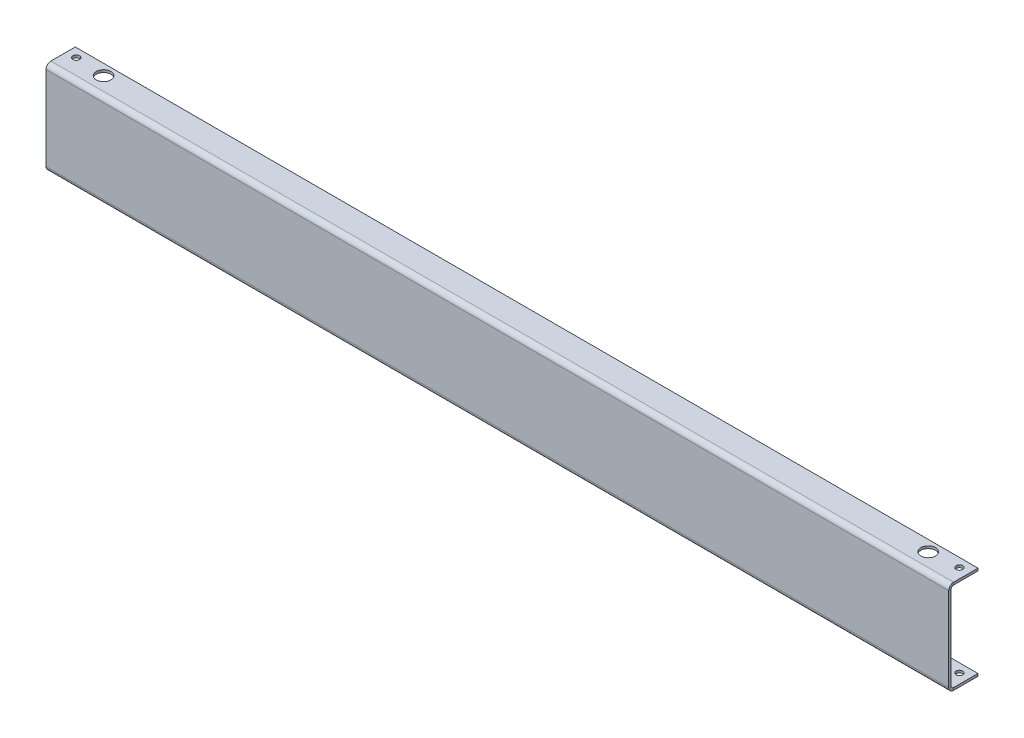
ISO-10303-21;
HEADER;
FILE_DESCRIPTION(('STEP AP214'),'2;1');
FILE_NAME('part.step','',(''),(''),'','','');
FILE_SCHEMA(('AUTOMOTIVE_DESIGN { 1 0 10303 214 1 1 1 1 }'));
ENDSEC;
DATA;
#1=APPLICATION_CONTEXT('core data for automotive mechanical design processes');
#2=APPLICATION_PROTOCOL_DEFINITION('international standard','automotive_design',2000,#1);
#3=PRODUCT_CONTEXT('',#1,'mechanical');
#4=PRODUCT('Part','Part','',(#3));
#5=PRODUCT_RELATED_PRODUCT_CATEGORY('part','',(#4));
#6=PRODUCT_DEFINITION_FORMATION('','',#4);
#7=PRODUCT_DEFINITION_CONTEXT('part definition',#1,'design');
#8=PRODUCT_DEFINITION('design','',#6,#7);
#9=PRODUCT_DEFINITION_SHAPE('','',#8);
#10=(LENGTH_UNIT() NAMED_UNIT(*) SI_UNIT(.MILLI.,.METRE.));
#11=(NAMED_UNIT(*) PLANE_ANGLE_UNIT() SI_UNIT($,.RADIAN.));
#12=(NAMED_UNIT(*) SI_UNIT($,.STERADIAN.) SOLID_ANGLE_UNIT());
#13=UNCERTAINTY_MEASURE_WITH_UNIT(LENGTH_MEASURE(1.E-05),#10,'distance_accuracy_value','');
#14=(GEOMETRIC_REPRESENTATION_CONTEXT(3) GLOBAL_UNCERTAINTY_ASSIGNED_CONTEXT((#13)) GLOBAL_UNIT_ASSIGNED_CONTEXT((#10,
#11,#12)) REPRESENTATION_CONTEXT('',''));
#15=CARTESIAN_POINT('',(0.,0.,0.));
#16=DIRECTION('',(0.,0.,1.));
#17=DIRECTION('',(1.,0.,0.));
#18=AXIS2_PLACEMENT_3D('',#15,#16,#17);
#19=CARTESIAN_POINT('',(925.,0.,0.));
#20=DIRECTION('',(0.,-1.,0.));
#21=DIRECTION('',(0.,0.,-1.));
#22=AXIS2_PLACEMENT_3D('',#19,#20,#21);
#23=PLANE('',#22);
#24=CARTESIAN_POINT('',(40.,0.,11.));
#25=DIRECTION('',(0.,1.,0.));
#26=DIRECTION('',(0.,0.,1.));
#27=AXIS2_PLACEMENT_3D('',#24,#25,#26);
#28=CIRCLE('',#27,7.49999999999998);
#29=CARTESIAN_POINT('',(40.,0.,18.4999999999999));
#30=VERTEX_POINT('',#29);
#31=EDGE_CURVE('E320',#30,#30,#28,.T.);
#32=ORIENTED_EDGE('',*,*,#31,.T.);
#33=EDGE_LOOP('',(#32));
#34=FACE_BOUND('',#33,.T.);
#35=CARTESIAN_POINT('',(915.,0.,8.99999999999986));
#36=DIRECTION('',(0.,1.,0.));
#37=DIRECTION('',(0.,0.,1.));
#38=AXIS2_PLACEMENT_3D('',#35,#36,#37);
#39=CIRCLE('',#38,3.39999999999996);
#40=CARTESIAN_POINT('',(915.,0.,12.3999999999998));
#41=VERTEX_POINT('',#40);
#42=EDGE_CURVE('E340',#41,#41,#39,.T.);
#43=ORIENTED_EDGE('',*,*,#42,.T.);
#44=EDGE_LOOP('',(#43));
#45=FACE_BOUND('',#44,.T.);
#46=DIRECTION('',(0.,0.,1.));
#47=VECTOR('',#46,1.);
#48=CARTESIAN_POINT('',(0.,0.,0.));
#49=LINE('',#48,#47);
#50=CARTESIAN_POINT('',(0.,0.,0.));
#51=VERTEX_POINT('',#50);
#52=CARTESIAN_POINT('',(0.,0.,25.));
#53=VERTEX_POINT('',#52);
#54=EDGE_CURVE('E176',#51,#53,#49,.T.);
#55=ORIENTED_EDGE('',*,*,#54,.F.);
#56=DIRECTION('',(-1.,0.,0.));
#57=VECTOR('',#56,1.);
#58=CARTESIAN_POINT('',(925.,0.,0.));
#59=LINE('',#58,#57);
#60=CARTESIAN_POINT('',(925.,0.,0.));
#61=VERTEX_POINT('',#60);
#62=EDGE_CURVE('E259',#61,#51,#59,.T.);
#63=ORIENTED_EDGE('',*,*,#62,.F.);
#64=DIRECTION('',(0.,0.,1.));
#65=VECTOR('',#64,1.);
#66=CARTESIAN_POINT('',(925.,0.,0.));
#67=LINE('',#66,#65);
#68=CARTESIAN_POINT('',(925.,0.,25.));
#69=VERTEX_POINT('',#68);
#70=EDGE_CURVE('E220',#61,#69,#67,.T.);
#71=ORIENTED_EDGE('',*,*,#70,.T.);
#72=DIRECTION('',(-1.,0.,0.));
#73=VECTOR('',#72,1.);
#74=CARTESIAN_POINT('',(925.,0.,25.));
#75=LINE('',#74,#73);
#76=EDGE_CURVE('E262',#69,#53,#75,.T.);
#77=ORIENTED_EDGE('',*,*,#76,.T.);
#78=EDGE_LOOP('',(#55,#63,#71,#77));
#79=FACE_BOUND('',#78,.T.);
#80=CARTESIAN_POINT('',(10.,0.,8.99999999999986));
#81=DIRECTION('',(0.,1.,0.));
#82=DIRECTION('',(0.,0.,1.));
#83=AXIS2_PLACEMENT_3D('',#80,#81,#82);
#84=CIRCLE('',#83,3.39999999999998);
#85=CARTESIAN_POINT('',(10.,0.,12.3999999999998));
#86=VERTEX_POINT('',#85);
#87=EDGE_CURVE('E316',#86,#86,#84,.T.);
#88=ORIENTED_EDGE('',*,*,#87,.T.);
#89=EDGE_LOOP('',(#88));
#90=FACE_BOUND('',#89,.T.);
#91=CARTESIAN_POINT('',(885.,0.,11.));
#92=DIRECTION('',(0.,1.,0.));
#93=DIRECTION('',(0.,0.,1.));
#94=AXIS2_PLACEMENT_3D('',#91,#92,#93);
#95=CIRCLE('',#94,7.49999999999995);
#96=CARTESIAN_POINT('',(885.,0.,18.4999999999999));
#97=VERTEX_POINT('',#96);
#98=EDGE_CURVE('E492',#97,#97,#95,.T.);
#99=ORIENTED_EDGE('',*,*,#98,.T.);
#100=EDGE_LOOP('',(#99));
#101=FACE_BOUND('',#100,.T.);
#102=ADVANCED_FACE('F38',(#34,#45,#79,#90,#101),#23,.T.);
#103=CARTESIAN_POINT('',(925.,5.,30.));
#104=DIRECTION('',(1.,0.,0.));
#105=DIRECTION('',(0.,0.,-1.));
#106=AXIS2_PLACEMENT_3D('',#103,#104,#105);
#107=PLANE('',#106);
#108=DIRECTION('',(0.,0.,-1.));
#109=VECTOR('',#108,1.);
#110=CARTESIAN_POINT('',(925.,5.,30.));
#111=LINE('',#110,#109);
#112=CARTESIAN_POINT('',(925.,5.,30.));
#113=VERTEX_POINT('',#112);
#114=CARTESIAN_POINT('',(925.,5.,27.5));
#115=VERTEX_POINT('',#114);
#116=EDGE_CURVE('E11',#113,#115,#111,.T.);
#117=ORIENTED_EDGE('',*,*,#116,.F.);
#118=CARTESIAN_POINT('',(925.,5.,25.));
#119=DIRECTION('',(1.,0.,0.));
#120=DIRECTION('',(0.,0.,-1.));
#121=AXIS2_PLACEMENT_3D('',#118,#119,#120);
#122=CIRCLE('',#121,5.);
#123=EDGE_CURVE('E216',#69,#113,#122,.F.);
#124=ORIENTED_EDGE('',*,*,#123,.F.);
#125=DIRECTION('',(0.,-1.,0.));
#126=VECTOR('',#125,1.);
#127=CARTESIAN_POINT('',(925.,2.5,25.));
#128=LINE('',#127,#126);
#129=CARTESIAN_POINT('',(925.,2.5,25.));
#130=VERTEX_POINT('',#129);
#131=EDGE_CURVE('E48',#130,#69,#128,.T.);
#132=ORIENTED_EDGE('',*,*,#131,.F.);
#133=CARTESIAN_POINT('',(925.,5.,25.));
#134=DIRECTION('',(1.,0.,0.));
#135=DIRECTION('',(0.,0.,-1.));
#136=AXIS2_PLACEMENT_3D('',#133,#134,#135);
#137=CIRCLE('',#136,2.5);
#138=EDGE_CURVE('E232',#130,#115,#137,.F.);
#139=ORIENTED_EDGE('',*,*,#138,.T.);
#140=EDGE_LOOP('',(#117,#124,#132,#139));
#141=FACE_BOUND('',#140,.T.);
#142=ADVANCED_FACE('F40',(#141),#107,.T.);
#143=CARTESIAN_POINT('',(925.,2.5,25.));
#144=DIRECTION('',(1.,0.,0.));
#145=DIRECTION('',(0.,0.,-1.));
#146=AXIS2_PLACEMENT_3D('',#143,#144,#145);
#147=PLANE('',#146);
#148=DIRECTION('',(0.,1.,0.));
#149=VECTOR('',#148,1.);
#150=CARTESIAN_POINT('',(925.,0.,30.));
#151=LINE('',#150,#149);
#152=CARTESIAN_POINT('',(925.,91.,30.));
#153=VERTEX_POINT('',#152);
#154=EDGE_CURVE('E212',#113,#153,#151,.T.);
#155=ORIENTED_EDGE('',*,*,#154,.F.);
#156=ORIENTED_EDGE('',*,*,#116,.T.);
#157=DIRECTION('',(0.,1.,0.));
#158=VECTOR('',#157,1.);
#159=CARTESIAN_POINT('',(925.,0.,27.5));
#160=LINE('',#159,#158);
#161=CARTESIAN_POINT('',(925.,91.,27.5));
#162=VERTEX_POINT('',#161);
#163=EDGE_CURVE('E236',#115,#162,#160,.T.);
#164=ORIENTED_EDGE('',*,*,#163,.T.);
#165=DIRECTION('',(0.,0.,1.));
#166=VECTOR('',#165,1.);
#167=CARTESIAN_POINT('',(925.,91.,27.5));
#168=LINE('',#167,#166);
#169=EDGE_CURVE('E63',#162,#153,#168,.T.);
#170=ORIENTED_EDGE('',*,*,#169,.T.);
#171=EDGE_LOOP('',(#155,#156,#164,#170));
#172=FACE_BOUND('',#171,.T.);
#173=ADVANCED_FACE('F371',(#172),#147,.T.);
#174=CARTESIAN_POINT('',(0.,0.,25.));
#175=DIRECTION('',(-1.,0.,0.));
#176=DIRECTION('',(0.,0.,1.));
#177=AXIS2_PLACEMENT_3D('',#174,#175,#176);
#178=PLANE('',#177);
#179=DIRECTION('',(0.,1.,0.));
#180=VECTOR('',#179,1.);
#181=CARTESIAN_POINT('',(0.,0.,25.));
#182=LINE('',#181,#180);
#183=CARTESIAN_POINT('',(0.,2.5,25.));
#184=VERTEX_POINT('',#183);
#185=EDGE_CURVE('E292',#53,#184,#182,.T.);
#186=ORIENTED_EDGE('',*,*,#185,.F.);
#187=CARTESIAN_POINT('',(0.,5.,25.));
#188=DIRECTION('',(1.,0.,0.));
#189=DIRECTION('',(0.,0.,-1.));
#190=AXIS2_PLACEMENT_3D('',#187,#188,#189);
#191=CIRCLE('',#190,5.);
#192=CARTESIAN_POINT('',(0.,5.,30.));
#193=VERTEX_POINT('',#192);
#194=EDGE_CURVE('E172',#53,#193,#191,.F.);
#195=ORIENTED_EDGE('',*,*,#194,.T.);
#196=DIRECTION('',(0.,0.,1.));
#197=VECTOR('',#196,1.);
#198=CARTESIAN_POINT('',(0.,5.,27.5));
#199=LINE('',#198,#197);
#200=CARTESIAN_POINT('',(0.,5.,27.5));
#201=VERTEX_POINT('',#200);
#202=EDGE_CURVE('E289',#201,#193,#199,.T.);
#203=ORIENTED_EDGE('',*,*,#202,.F.);
#204=CARTESIAN_POINT('',(0.,5.,25.));
#205=DIRECTION('',(1.,0.,0.));
#206=DIRECTION('',(0.,0.,-1.));
#207=AXIS2_PLACEMENT_3D('',#204,#205,#206);
#208=CIRCLE('',#207,2.5);
#209=EDGE_CURVE('E188',#184,#201,#208,.F.);
#210=ORIENTED_EDGE('',*,*,#209,.F.);
#211=EDGE_LOOP('',(#186,#195,#203,#210));
#212=FACE_BOUND('',#211,.T.);
#213=ADVANCED_FACE('F416',(#212),#178,.T.);
#214=CARTESIAN_POINT('',(0.,5.,27.5));
#215=DIRECTION('',(-1.,0.,0.));
#216=DIRECTION('',(0.,0.,1.));
#217=AXIS2_PLACEMENT_3D('',#214,#215,#216);
#218=PLANE('',#217);
#219=ORIENTED_EDGE('',*,*,#54,.T.);
#220=ORIENTED_EDGE('',*,*,#185,.T.);
#221=DIRECTION('',(0.,0.,1.));
#222=VECTOR('',#221,1.);
#223=CARTESIAN_POINT('',(0.,2.5,0.));
#224=LINE('',#223,#222);
#225=CARTESIAN_POINT('',(0.,2.5,0.));
#226=VERTEX_POINT('',#225);
#227=EDGE_CURVE('E184',#226,#184,#224,.T.);
#228=ORIENTED_EDGE('',*,*,#227,.F.);
#229=DIRECTION('',(0.,-1.,0.));
#230=VECTOR('',#229,1.);
#231=CARTESIAN_POINT('',(0.,2.5,0.));
#232=LINE('',#231,#230);
#233=EDGE_CURVE('E180',#226,#51,#232,.T.);
#234=ORIENTED_EDGE('',*,*,#233,.T.);
#235=EDGE_LOOP('',(#219,#220,#228,#234));
#236=FACE_BOUND('',#235,.T.);
#237=ADVANCED_FACE('F413',(#236),#218,.T.);
#238=CARTESIAN_POINT('',(925.,96.,25.));
#239=DIRECTION('',(1.,0.,0.));
#240=DIRECTION('',(0.,0.,-1.));
#241=AXIS2_PLACEMENT_3D('',#238,#239,#240);
#242=PLANE('',#241);
#243=DIRECTION('',(0.,-1.,0.));
#244=VECTOR('',#243,1.);
#245=CARTESIAN_POINT('',(925.,96.,25.));
#246=LINE('',#245,#244);
#247=CARTESIAN_POINT('',(925.,96.,25.));
#248=VERTEX_POINT('',#247);
#249=CARTESIAN_POINT('',(925.,93.5,25.));
#250=VERTEX_POINT('',#249);
#251=EDGE_CURVE('E56',#248,#250,#246,.T.);
#252=ORIENTED_EDGE('',*,*,#251,.F.);
#253=CARTESIAN_POINT('',(925.,91.,25.));
#254=DIRECTION('',(1.,0.,0.));
#255=DIRECTION('',(0.,0.,-1.));
#256=AXIS2_PLACEMENT_3D('',#253,#254,#255);
#257=CIRCLE('',#256,5.);
#258=EDGE_CURVE('E208',#153,#248,#257,.F.);
#259=ORIENTED_EDGE('',*,*,#258,.F.);
#260=ORIENTED_EDGE('',*,*,#169,.F.);
#261=CARTESIAN_POINT('',(925.,91.,25.));
#262=DIRECTION('',(1.,0.,0.));
#263=DIRECTION('',(0.,0.,-1.));
#264=AXIS2_PLACEMENT_3D('',#261,#262,#263);
#265=CIRCLE('',#264,2.5);
#266=EDGE_CURVE('E239',#162,#250,#265,.F.);
#267=ORIENTED_EDGE('',*,*,#266,.T.);
#268=EDGE_LOOP('',(#252,#259,#260,#267));
#269=FACE_BOUND('',#268,.T.);
#270=ADVANCED_FACE('F410',(#269),#242,.T.);
#271=CARTESIAN_POINT('',(925.,91.,27.5));
#272=DIRECTION('',(1.,0.,0.));
#273=DIRECTION('',(0.,0.,-1.));
#274=AXIS2_PLACEMENT_3D('',#271,#272,#273);
#275=PLANE('',#274);
#276=DIRECTION('',(0.,0.,-1.));
#277=VECTOR('',#276,1.);
#278=CARTESIAN_POINT('',(925.,96.,30.));
#279=LINE('',#278,#277);
#280=CARTESIAN_POINT('',(925.,96.,0.));
#281=VERTEX_POINT('',#280);
#282=EDGE_CURVE('E204',#248,#281,#279,.T.);
#283=ORIENTED_EDGE('',*,*,#282,.F.);
#284=ORIENTED_EDGE('',*,*,#251,.T.);
#285=DIRECTION('',(0.,0.,-1.));
#286=VECTOR('',#285,1.);
#287=CARTESIAN_POINT('',(925.,93.5,30.));
#288=LINE('',#287,#286);
#289=CARTESIAN_POINT('',(925.,93.5,0.));
#290=VERTEX_POINT('',#289);
#291=EDGE_CURVE('E199',#250,#290,#288,.T.);
#292=ORIENTED_EDGE('',*,*,#291,.T.);
#293=DIRECTION('',(0.,-1.,0.));
#294=VECTOR('',#293,1.);
#295=CARTESIAN_POINT('',(925.,96.,0.));
#296=LINE('',#295,#294);
#297=EDGE_CURVE('E137',#281,#290,#296,.T.);
#298=ORIENTED_EDGE('',*,*,#297,.F.);
#299=EDGE_LOOP('',(#283,#284,#292,#298));
#300=FACE_BOUND('',#299,.T.);
#301=ADVANCED_FACE('F406',(#300),#275,.T.);
#302=CARTESIAN_POINT('',(0.,91.,30.));
#303=DIRECTION('',(-1.,0.,0.));
#304=DIRECTION('',(0.,0.,1.));
#305=AXIS2_PLACEMENT_3D('',#302,#303,#304);
#306=PLANE('',#305);
#307=DIRECTION('',(0.,0.,-1.));
#308=VECTOR('',#307,1.);
#309=CARTESIAN_POINT('',(0.,91.,30.));
#310=LINE('',#309,#308);
#311=CARTESIAN_POINT('',(0.,91.,30.));
#312=VERTEX_POINT('',#311);
#313=CARTESIAN_POINT('',(0.,91.,27.5));
#314=VERTEX_POINT('',#313);
#315=EDGE_CURVE('E282',#312,#314,#310,.T.);
#316=ORIENTED_EDGE('',*,*,#315,.F.);
#317=CARTESIAN_POINT('',(0.,91.,25.));
#318=DIRECTION('',(1.,0.,0.));
#319=DIRECTION('',(0.,0.,-1.));
#320=AXIS2_PLACEMENT_3D('',#317,#318,#319);
#321=CIRCLE('',#320,5.);
#322=CARTESIAN_POINT('',(0.,96.,25.));
#323=VERTEX_POINT('',#322);
#324=EDGE_CURVE('E161',#312,#323,#321,.F.);
#325=ORIENTED_EDGE('',*,*,#324,.T.);
#326=DIRECTION('',(0.,1.,0.));
#327=VECTOR('',#326,1.);
#328=CARTESIAN_POINT('',(0.,93.5,25.));
#329=LINE('',#328,#327);
#330=CARTESIAN_POINT('',(0.,93.5,25.));
#331=VERTEX_POINT('',#330);
#332=EDGE_CURVE('E141',#331,#323,#329,.T.);
#333=ORIENTED_EDGE('',*,*,#332,.F.);
#334=CARTESIAN_POINT('',(0.,91.,25.));
#335=DIRECTION('',(1.,0.,0.));
#336=DIRECTION('',(0.,0.,-1.));
#337=AXIS2_PLACEMENT_3D('',#334,#335,#336);
#338=CIRCLE('',#337,2.5);
#339=EDGE_CURVE('E195',#314,#331,#338,.F.);
#340=ORIENTED_EDGE('',*,*,#339,.F.);
#341=EDGE_LOOP('',(#316,#325,#333,#340));
#342=FACE_BOUND('',#341,.T.);
#343=ADVANCED_FACE('F402',(#342),#306,.T.);
#344=CARTESIAN_POINT('',(0.,93.5,25.));
#345=DIRECTION('',(-1.,0.,0.));
#346=DIRECTION('',(0.,0.,1.));
#347=AXIS2_PLACEMENT_3D('',#344,#345,#346);
#348=PLANE('',#347);
#349=DIRECTION('',(0.,1.,0.));
#350=VECTOR('',#349,1.);
#351=CARTESIAN_POINT('',(0.,0.,30.));
#352=LINE('',#351,#350);
#353=EDGE_CURVE('E168',#193,#312,#352,.T.);
#354=ORIENTED_EDGE('',*,*,#353,.T.);
#355=ORIENTED_EDGE('',*,*,#315,.T.);
#356=DIRECTION('',(0.,1.,0.));
#357=VECTOR('',#356,1.);
#358=CARTESIAN_POINT('',(0.,0.,27.5));
#359=LINE('',#358,#357);
#360=EDGE_CURVE('E191',#201,#314,#359,.T.);
#361=ORIENTED_EDGE('',*,*,#360,.F.);
#362=ORIENTED_EDGE('',*,*,#202,.T.);
#363=EDGE_LOOP('',(#354,#355,#361,#362));
#364=FACE_BOUND('',#363,.T.);
#365=ADVANCED_FACE('F398',(#364),#348,.T.);
#366=CARTESIAN_POINT('',(925.,93.5,30.));
#367=DIRECTION('',(0.,1.,0.));
#368=DIRECTION('',(0.,0.,1.));
#369=AXIS2_PLACEMENT_3D('',#366,#367,#368);
#370=PLANE('',#369);
#371=CARTESIAN_POINT('',(885.,93.5,11.));
#372=DIRECTION('',(0.,1.,0.));
#373=DIRECTION('',(0.,0.,1.));
#374=AXIS2_PLACEMENT_3D('',#371,#372,#373);
#375=CIRCLE('',#374,7.49999999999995);
#376=CARTESIAN_POINT('',(885.,93.5,18.4999999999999));
#377=VERTEX_POINT('',#376);
#378=EDGE_CURVE('E327',#377,#377,#375,.T.);
#379=ORIENTED_EDGE('',*,*,#378,.T.);
#380=EDGE_LOOP('',(#379));
#381=FACE_BOUND('',#380,.T.);
#382=CARTESIAN_POINT('',(40.,93.5,11.));
#383=DIRECTION('',(0.,1.,0.));
#384=DIRECTION('',(0.,0.,1.));
#385=AXIS2_PLACEMENT_3D('',#382,#383,#384);
#386=CIRCLE('',#385,7.49999999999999);
#387=CARTESIAN_POINT('',(40.,93.5,18.5));
#388=VERTEX_POINT('',#387);
#389=EDGE_CURVE('E310',#388,#388,#386,.T.);
#390=ORIENTED_EDGE('',*,*,#389,.T.);
#391=EDGE_LOOP('',(#390));
#392=FACE_BOUND('',#391,.T.);
#393=CARTESIAN_POINT('',(10.,93.5,9.));
#394=DIRECTION('',(0.,1.,0.));
#395=DIRECTION('',(0.,0.,1.));
#396=AXIS2_PLACEMENT_3D('',#393,#394,#395);
#397=CIRCLE('',#396,3.39999999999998);
#398=CARTESIAN_POINT('',(10.,93.5,12.4));
#399=VERTEX_POINT('',#398);
#400=EDGE_CURVE('E305',#399,#399,#397,.T.);
#401=ORIENTED_EDGE('',*,*,#400,.T.);
#402=EDGE_LOOP('',(#401));
#403=FACE_BOUND('',#402,.T.);
#404=CARTESIAN_POINT('',(915.,93.5,9.));
#405=DIRECTION('',(0.,1.,0.));
#406=DIRECTION('',(0.,0.,1.));
#407=AXIS2_PLACEMENT_3D('',#404,#405,#406);
#408=CIRCLE('',#407,3.39999999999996);
#409=CARTESIAN_POINT('',(915.,93.5,12.4));
#410=VERTEX_POINT('',#409);
#411=EDGE_CURVE('E152',#410,#410,#408,.T.);
#412=ORIENTED_EDGE('',*,*,#411,.T.);
#413=EDGE_LOOP('',(#412));
#414=FACE_BOUND('',#413,.T.);
#415=DIRECTION('',(0.,0.,-1.));
#416=VECTOR('',#415,1.);
#417=CARTESIAN_POINT('',(0.,93.5,30.));
#418=LINE('',#417,#416);
#419=CARTESIAN_POINT('',(0.,93.5,0.));
#420=VERTEX_POINT('',#419);
#421=EDGE_CURVE('E146',#331,#420,#418,.T.);
#422=ORIENTED_EDGE('',*,*,#421,.T.);
#423=DIRECTION('',(-1.,0.,0.));
#424=VECTOR('',#423,1.);
#425=CARTESIAN_POINT('',(925.,93.5,0.));
#426=LINE('',#425,#424);
#427=EDGE_CURVE('E130',#290,#420,#426,.T.);
#428=ORIENTED_EDGE('',*,*,#427,.F.);
#429=ORIENTED_EDGE('',*,*,#291,.F.);
#430=DIRECTION('',(-1.,0.,0.));
#431=VECTOR('',#430,1.);
#432=CARTESIAN_POINT('',(925.,93.5,25.));
#433=LINE('',#432,#431);
#434=EDGE_CURVE('E149',#250,#331,#433,.T.);
#435=ORIENTED_EDGE('',*,*,#434,.T.);
#436=EDGE_LOOP('',(#422,#428,#429,#435));
#437=FACE_BOUND('',#436,.T.);
#438=ADVANCED_FACE('F147',(#381,#392,#403,#414,#437),#370,.F.);
#439=CARTESIAN_POINT('',(925.,96.,0.));
#440=DIRECTION('',(0.,0.,-1.));
#441=DIRECTION('',(-1.,0.,0.));
#442=AXIS2_PLACEMENT_3D('',#439,#440,#441);
#443=PLANE('',#442);
#444=DIRECTION('',(0.,-1.,0.));
#445=VECTOR('',#444,1.);
#446=CARTESIAN_POINT('',(0.,96.,0.));
#447=LINE('',#446,#445);
#448=CARTESIAN_POINT('',(0.,96.,0.));
#449=VERTEX_POINT('',#448);
#450=EDGE_CURVE('E134',#449,#420,#447,.T.);
#451=ORIENTED_EDGE('',*,*,#450,.F.);
#452=DIRECTION('',(-1.,0.,0.));
#453=VECTOR('',#452,1.);
#454=CARTESIAN_POINT('',(925.,96.,0.));
#455=LINE('',#454,#453);
#456=EDGE_CURVE('E142',#281,#449,#455,.T.);
#457=ORIENTED_EDGE('',*,*,#456,.F.);
#458=ORIENTED_EDGE('',*,*,#297,.T.);
#459=ORIENTED_EDGE('',*,*,#427,.T.);
#460=EDGE_LOOP('',(#451,#457,#458,#459));
#461=FACE_BOUND('',#460,.T.);
#462=ADVANCED_FACE('F132',(#461),#443,.T.);
#463=CARTESIAN_POINT('',(925.,96.,30.));
#464=DIRECTION('',(0.,1.,0.));
#465=DIRECTION('',(0.,0.,1.));
#466=AXIS2_PLACEMENT_3D('',#463,#464,#465);
#467=PLANE('',#466);
#468=CARTESIAN_POINT('',(885.,96.,11.));
#469=DIRECTION('',(0.,1.,0.));
#470=DIRECTION('',(0.,0.,1.));
#471=AXIS2_PLACEMENT_3D('',#468,#469,#470);
#472=CIRCLE('',#471,7.49999999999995);
#473=CARTESIAN_POINT('',(885.,96.,18.5));
#474=VERTEX_POINT('',#473);
#475=EDGE_CURVE('E487',#474,#474,#472,.T.);
#476=ORIENTED_EDGE('',*,*,#475,.F.);
#477=EDGE_LOOP('',(#476));
#478=FACE_BOUND('',#477,.T.);
#479=CARTESIAN_POINT('',(40.,96.,11.));
#480=DIRECTION('',(0.,1.,0.));
#481=DIRECTION('',(0.,0.,1.));
#482=AXIS2_PLACEMENT_3D('',#479,#480,#481);
#483=CIRCLE('',#482,7.49999999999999);
#484=CARTESIAN_POINT('',(40.,96.,18.5));
#485=VERTEX_POINT('',#484);
#486=EDGE_CURVE('E311',#485,#485,#483,.T.);
#487=ORIENTED_EDGE('',*,*,#486,.F.);
#488=EDGE_LOOP('',(#487));
#489=FACE_BOUND('',#488,.T.);
#490=CARTESIAN_POINT('',(10.,96.,9.));
#491=DIRECTION('',(0.,1.,0.));
#492=DIRECTION('',(0.,0.,1.));
#493=AXIS2_PLACEMENT_3D('',#490,#491,#492);
#494=CIRCLE('',#493,3.39999999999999);
#495=CARTESIAN_POINT('',(10.,96.,12.4));
#496=VERTEX_POINT('',#495);
#497=EDGE_CURVE('E306',#496,#496,#494,.T.);
#498=ORIENTED_EDGE('',*,*,#497,.F.);
#499=EDGE_LOOP('',(#498));
#500=FACE_BOUND('',#499,.T.);
#501=CARTESIAN_POINT('',(915.,96.,9.));
#502=DIRECTION('',(0.,1.,0.));
#503=DIRECTION('',(0.,0.,1.));
#504=AXIS2_PLACEMENT_3D('',#501,#502,#503);
#505=CIRCLE('',#504,3.39999999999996);
#506=CARTESIAN_POINT('',(915.,96.,12.4));
#507=VERTEX_POINT('',#506);
#508=EDGE_CURVE('E301',#507,#507,#505,.T.);
#509=ORIENTED_EDGE('',*,*,#508,.F.);
#510=EDGE_LOOP('',(#509));
#511=FACE_BOUND('',#510,.T.);
#512=DIRECTION('',(0.,0.,-1.));
#513=VECTOR('',#512,1.);
#514=CARTESIAN_POINT('',(0.,96.,30.));
#515=LINE('',#514,#513);
#516=EDGE_CURVE('E156',#323,#449,#515,.T.);
#517=ORIENTED_EDGE('',*,*,#516,.F.);
#518=DIRECTION('',(-1.,0.,0.));
#519=VECTOR('',#518,1.);
#520=CARTESIAN_POINT('',(925.,96.,25.));
#521=LINE('',#520,#519);
#522=EDGE_CURVE('E274',#248,#323,#521,.T.);
#523=ORIENTED_EDGE('',*,*,#522,.F.);
#524=ORIENTED_EDGE('',*,*,#282,.T.);
#525=ORIENTED_EDGE('',*,*,#456,.T.);
#526=EDGE_LOOP('',(#517,#523,#524,#525));
#527=FACE_BOUND('',#526,.T.);
#528=ADVANCED_FACE('F389',(#478,#489,#500,#511,#527),#467,.T.);
#529=CARTESIAN_POINT('',(925.,91.,25.));
#530=DIRECTION('',(-1.,0.,0.));
#531=DIRECTION('',(0.,0.,1.));
#532=AXIS2_PLACEMENT_3D('',#529,#530,#531);
#533=CYLINDRICAL_SURFACE('',#532,5.);
#534=ORIENTED_EDGE('',*,*,#324,.F.);
#535=DIRECTION('',(-1.,0.,0.));
#536=VECTOR('',#535,1.);
#537=CARTESIAN_POINT('',(925.,91.,30.));
#538=LINE('',#537,#536);
#539=EDGE_CURVE('E270',#153,#312,#538,.T.);
#540=ORIENTED_EDGE('',*,*,#539,.F.);
#541=ORIENTED_EDGE('',*,*,#258,.T.);
#542=ORIENTED_EDGE('',*,*,#522,.T.);
#543=EDGE_LOOP('',(#534,#540,#541,#542));
#544=FACE_BOUND('',#543,.T.);
#545=ADVANCED_FACE('F385',(#544),#533,.T.);
#546=CARTESIAN_POINT('',(925.,0.,30.));
#547=DIRECTION('',(0.,0.,1.));
#548=DIRECTION('',(1.,0.,0.));
#549=AXIS2_PLACEMENT_3D('',#546,#547,#548);
#550=PLANE('',#549);
#551=ORIENTED_EDGE('',*,*,#353,.F.);
#552=DIRECTION('',(-1.,0.,0.));
#553=VECTOR('',#552,1.);
#554=CARTESIAN_POINT('',(925.,5.,30.));
#555=LINE('',#554,#553);
#556=EDGE_CURVE('E266',#113,#193,#555,.T.);
#557=ORIENTED_EDGE('',*,*,#556,.F.);
#558=ORIENTED_EDGE('',*,*,#154,.T.);
#559=ORIENTED_EDGE('',*,*,#539,.T.);
#560=EDGE_LOOP('',(#551,#557,#558,#559));
#561=FACE_BOUND('',#560,.T.);
#562=ADVANCED_FACE('F381',(#561),#550,.T.);
#563=CARTESIAN_POINT('',(925.,5.,25.));
#564=DIRECTION('',(-1.,0.,0.));
#565=DIRECTION('',(0.,0.,1.));
#566=AXIS2_PLACEMENT_3D('',#563,#564,#565);
#567=CYLINDRICAL_SURFACE('',#566,5.);
#568=ORIENTED_EDGE('',*,*,#194,.F.);
#569=ORIENTED_EDGE('',*,*,#76,.F.);
#570=ORIENTED_EDGE('',*,*,#123,.T.);
#571=ORIENTED_EDGE('',*,*,#556,.T.);
#572=EDGE_LOOP('',(#568,#569,#570,#571));
#573=FACE_BOUND('',#572,.T.);
#574=ADVANCED_FACE('F378',(#573),#567,.T.);
#575=CARTESIAN_POINT('',(925.,2.5,0.));
#576=DIRECTION('',(0.,0.,-1.));
#577=DIRECTION('',(0.,1.,0.));
#578=AXIS2_PLACEMENT_3D('',#575,#576,#577);
#579=PLANE('',#578);
#580=ORIENTED_EDGE('',*,*,#233,.F.);
#581=DIRECTION('',(-1.,0.,0.));
#582=VECTOR('',#581,1.);
#583=CARTESIAN_POINT('',(925.,2.5,0.));
#584=LINE('',#583,#582);
#585=CARTESIAN_POINT('',(925.,2.5,0.));
#586=VERTEX_POINT('',#585);
#587=EDGE_CURVE('E256',#586,#226,#584,.T.);
#588=ORIENTED_EDGE('',*,*,#587,.F.);
#589=DIRECTION('',(0.,-1.,0.));
#590=VECTOR('',#589,1.);
#591=CARTESIAN_POINT('',(925.,2.5,0.));
#592=LINE('',#591,#590);
#593=EDGE_CURVE('E224',#586,#61,#592,.T.);
#594=ORIENTED_EDGE('',*,*,#593,.T.);
#595=ORIENTED_EDGE('',*,*,#62,.T.);
#596=EDGE_LOOP('',(#580,#588,#594,#595));
#597=FACE_BOUND('',#596,.T.);
#598=ADVANCED_FACE('F376',(#597),#579,.T.);
#599=CARTESIAN_POINT('',(925.,2.5,0.));
#600=DIRECTION('',(0.,-1.,0.));
#601=DIRECTION('',(0.,0.,-1.));
#602=AXIS2_PLACEMENT_3D('',#599,#600,#601);
#603=PLANE('',#602);
#604=CARTESIAN_POINT('',(885.,2.5,11.));
#605=DIRECTION('',(0.,-1.,0.));
#606=DIRECTION('',(0.,0.,-1.));
#607=AXIS2_PLACEMENT_3D('',#604,#605,#606);
#608=CIRCLE('',#607,7.49999999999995);
#609=CARTESIAN_POINT('',(885.,2.5,3.5));
#610=VERTEX_POINT('',#609);
#611=EDGE_CURVE('E42',#610,#610,#608,.T.);
#612=ORIENTED_EDGE('',*,*,#611,.T.);
#613=EDGE_LOOP('',(#612));
#614=FACE_BOUND('',#613,.T.);
#615=CARTESIAN_POINT('',(40.,2.5,11.));
#616=DIRECTION('',(0.,-1.,0.));
#617=DIRECTION('',(0.,0.,-1.));
#618=AXIS2_PLACEMENT_3D('',#615,#616,#617);
#619=CIRCLE('',#618,7.49999999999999);
#620=CARTESIAN_POINT('',(40.,2.5,3.49999999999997));
#621=VERTEX_POINT('',#620);
#622=EDGE_CURVE('E307',#621,#621,#619,.T.);
#623=ORIENTED_EDGE('',*,*,#622,.T.);
#624=EDGE_LOOP('',(#623));
#625=FACE_BOUND('',#624,.T.);
#626=CARTESIAN_POINT('',(10.,2.5,8.99999999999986));
#627=DIRECTION('',(0.,-1.,0.));
#628=DIRECTION('',(0.,0.,-1.));
#629=AXIS2_PLACEMENT_3D('',#626,#627,#628);
#630=CIRCLE('',#629,3.39999999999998);
#631=CARTESIAN_POINT('',(10.,2.5,5.59999999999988));
#632=VERTEX_POINT('',#631);
#633=EDGE_CURVE('E302',#632,#632,#630,.T.);
#634=ORIENTED_EDGE('',*,*,#633,.T.);
#635=EDGE_LOOP('',(#634));
#636=FACE_BOUND('',#635,.T.);
#637=CARTESIAN_POINT('',(915.,2.5,8.99999999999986));
#638=DIRECTION('',(0.,-1.,0.));
#639=DIRECTION('',(0.,0.,-1.));
#640=AXIS2_PLACEMENT_3D('',#637,#638,#639);
#641=CIRCLE('',#640,3.39999999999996);
#642=CARTESIAN_POINT('',(915.,2.5,5.59999999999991));
#643=VERTEX_POINT('',#642);
#644=EDGE_CURVE('E297',#643,#643,#641,.T.);
#645=ORIENTED_EDGE('',*,*,#644,.T.);
#646=EDGE_LOOP('',(#645));
#647=FACE_BOUND('',#646,.T.);
#648=ORIENTED_EDGE('',*,*,#227,.T.);
#649=DIRECTION('',(-1.,0.,0.));
#650=VECTOR('',#649,1.);
#651=CARTESIAN_POINT('',(925.,2.5,25.));
#652=LINE('',#651,#650);
#653=EDGE_CURVE('E252',#130,#184,#652,.T.);
#654=ORIENTED_EDGE('',*,*,#653,.F.);
#655=DIRECTION('',(0.,0.,1.));
#656=VECTOR('',#655,1.);
#657=CARTESIAN_POINT('',(925.,2.5,0.));
#658=LINE('',#657,#656);
#659=EDGE_CURVE('E228',#586,#130,#658,.T.);
#660=ORIENTED_EDGE('',*,*,#659,.F.);
#661=ORIENTED_EDGE('',*,*,#587,.T.);
#662=EDGE_LOOP('',(#648,#654,#660,#661));
#663=FACE_BOUND('',#662,.T.);
#664=ADVANCED_FACE('F444',(#614,#625,#636,#647,#663),#603,.F.);
#665=CARTESIAN_POINT('',(925.,5.,25.));
#666=DIRECTION('',(-1.,0.,0.));
#667=DIRECTION('',(0.,0.,1.));
#668=AXIS2_PLACEMENT_3D('',#665,#666,#667);
#669=CYLINDRICAL_SURFACE('',#668,2.5);
#670=ORIENTED_EDGE('',*,*,#209,.T.);
#671=DIRECTION('',(-1.,0.,0.));
#672=VECTOR('',#671,1.);
#673=CARTESIAN_POINT('',(925.,5.,27.5));
#674=LINE('',#673,#672);
#675=EDGE_CURVE('E248',#115,#201,#674,.T.);
#676=ORIENTED_EDGE('',*,*,#675,.F.);
#677=ORIENTED_EDGE('',*,*,#138,.F.);
#678=ORIENTED_EDGE('',*,*,#653,.T.);
#679=EDGE_LOOP('',(#670,#676,#677,#678));
#680=FACE_BOUND('',#679,.T.);
#681=ADVANCED_FACE('F449',(#680),#669,.F.);
#682=CARTESIAN_POINT('',(925.,0.,27.5));
#683=DIRECTION('',(0.,0.,1.));
#684=DIRECTION('',(1.,0.,0.));
#685=AXIS2_PLACEMENT_3D('',#682,#683,#684);
#686=PLANE('',#685);
#687=ORIENTED_EDGE('',*,*,#360,.T.);
#688=DIRECTION('',(-1.,0.,0.));
#689=VECTOR('',#688,1.);
#690=CARTESIAN_POINT('',(925.,91.,27.5));
#691=LINE('',#690,#689);
#692=EDGE_CURVE('E244',#162,#314,#691,.T.);
#693=ORIENTED_EDGE('',*,*,#692,.F.);
#694=ORIENTED_EDGE('',*,*,#163,.F.);
#695=ORIENTED_EDGE('',*,*,#675,.T.);
#696=EDGE_LOOP('',(#687,#693,#694,#695));
#697=FACE_BOUND('',#696,.T.);
#698=ADVANCED_FACE('F454',(#697),#686,.F.);
#699=CARTESIAN_POINT('',(925.,91.,25.));
#700=DIRECTION('',(-1.,0.,0.));
#701=DIRECTION('',(0.,0.,1.));
#702=AXIS2_PLACEMENT_3D('',#699,#700,#701);
#703=CYLINDRICAL_SURFACE('',#702,2.5);
#704=ORIENTED_EDGE('',*,*,#339,.T.);
#705=ORIENTED_EDGE('',*,*,#434,.F.);
#706=ORIENTED_EDGE('',*,*,#266,.F.);
#707=ORIENTED_EDGE('',*,*,#692,.T.);
#708=EDGE_LOOP('',(#704,#705,#706,#707));
#709=FACE_BOUND('',#708,.T.);
#710=ADVANCED_FACE('F458',(#709),#703,.F.);
#711=CARTESIAN_POINT('',(925.,91.,25.));
#712=DIRECTION('',(1.,0.,0.));
#713=DIRECTION('',(0.,0.,-1.));
#714=AXIS2_PLACEMENT_3D('',#711,#712,#713);
#715=PLANE('',#714);
#716=ORIENTED_EDGE('',*,*,#659,.T.);
#717=ORIENTED_EDGE('',*,*,#131,.T.);
#718=ORIENTED_EDGE('',*,*,#70,.F.);
#719=ORIENTED_EDGE('',*,*,#593,.F.);
#720=EDGE_LOOP('',(#716,#717,#718,#719));
#721=FACE_BOUND('',#720,.T.);
#722=ADVANCED_FACE('F437',(#721),#715,.T.);
#723=CARTESIAN_POINT('',(0.,91.,25.));
#724=DIRECTION('',(1.,0.,0.));
#725=DIRECTION('',(0.,0.,-1.));
#726=AXIS2_PLACEMENT_3D('',#723,#724,#725);
#727=PLANE('',#726);
#728=ORIENTED_EDGE('',*,*,#421,.F.);
#729=ORIENTED_EDGE('',*,*,#332,.T.);
#730=ORIENTED_EDGE('',*,*,#516,.T.);
#731=ORIENTED_EDGE('',*,*,#450,.T.);
#732=EDGE_LOOP('',(#728,#729,#730,#731));
#733=FACE_BOUND('',#732,.T.);
#734=ADVANCED_FACE('F154',(#733),#727,.F.);
#735=CARTESIAN_POINT('',(915.,96.,9.));
#736=DIRECTION('',(0.,1.,0.));
#737=DIRECTION('',(0.,0.,1.));
#738=AXIS2_PLACEMENT_3D('',#735,#736,#737);
#739=CYLINDRICAL_SURFACE('',#738,3.39999999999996);
#740=ORIENTED_EDGE('',*,*,#42,.F.);
#741=EDGE_LOOP('',(#740));
#742=FACE_BOUND('',#741,.T.);
#743=ORIENTED_EDGE('',*,*,#644,.F.);
#744=EDGE_LOOP('',(#743));
#745=FACE_BOUND('',#744,.T.);
#746=ADVANCED_FACE('F353',(#742,#745),#739,.F.);
#747=ORIENTED_EDGE('',*,*,#508,.T.);
#748=EDGE_LOOP('',(#747));
#749=FACE_BOUND('',#748,.T.);
#750=ORIENTED_EDGE('',*,*,#411,.F.);
#751=EDGE_LOOP('',(#750));
#752=FACE_BOUND('',#751,.T.);
#753=ADVANCED_FACE('F350',(#749,#752),#739,.F.);
#754=CARTESIAN_POINT('',(10.,96.,9.));
#755=DIRECTION('',(0.,1.,0.));
#756=DIRECTION('',(0.,0.,1.));
#757=AXIS2_PLACEMENT_3D('',#754,#755,#756);
#758=CYLINDRICAL_SURFACE('',#757,3.39999999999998);
#759=ORIENTED_EDGE('',*,*,#87,.F.);
#760=EDGE_LOOP('',(#759));
#761=FACE_BOUND('',#760,.T.);
#762=ORIENTED_EDGE('',*,*,#633,.F.);
#763=EDGE_LOOP('',(#762));
#764=FACE_BOUND('',#763,.T.);
#765=ADVANCED_FACE('F352',(#761,#764),#758,.F.);
#766=ORIENTED_EDGE('',*,*,#497,.T.);
#767=EDGE_LOOP('',(#766));
#768=FACE_BOUND('',#767,.T.);
#769=ORIENTED_EDGE('',*,*,#400,.F.);
#770=EDGE_LOOP('',(#769));
#771=FACE_BOUND('',#770,.T.);
#772=ADVANCED_FACE('F360',(#768,#771),#758,.F.);
#773=CARTESIAN_POINT('',(40.,96.,11.));
#774=DIRECTION('',(0.,1.,0.));
#775=DIRECTION('',(0.,0.,1.));
#776=AXIS2_PLACEMENT_3D('',#773,#774,#775);
#777=CYLINDRICAL_SURFACE('',#776,7.49999999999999);
#778=ORIENTED_EDGE('',*,*,#31,.F.);
#779=EDGE_LOOP('',(#778));
#780=FACE_BOUND('',#779,.T.);
#781=ORIENTED_EDGE('',*,*,#622,.F.);
#782=EDGE_LOOP('',(#781));
#783=FACE_BOUND('',#782,.T.);
#784=ADVANCED_FACE('F511',(#780,#783),#777,.F.);
#785=ORIENTED_EDGE('',*,*,#486,.T.);
#786=EDGE_LOOP('',(#785));
#787=FACE_BOUND('',#786,.T.);
#788=ORIENTED_EDGE('',*,*,#389,.F.);
#789=EDGE_LOOP('',(#788));
#790=FACE_BOUND('',#789,.T.);
#791=ADVANCED_FACE('F505',(#787,#790),#777,.F.);
#792=CARTESIAN_POINT('',(885.,96.,11.));
#793=DIRECTION('',(0.,1.,0.));
#794=DIRECTION('',(0.,0.,1.));
#795=AXIS2_PLACEMENT_3D('',#792,#793,#794);
#796=CYLINDRICAL_SURFACE('',#795,7.49999999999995);
#797=ORIENTED_EDGE('',*,*,#98,.F.);
#798=EDGE_LOOP('',(#797));
#799=FACE_BOUND('',#798,.T.);
#800=ORIENTED_EDGE('',*,*,#611,.F.);
#801=EDGE_LOOP('',(#800));
#802=FACE_BOUND('',#801,.T.);
#803=ADVANCED_FACE('F502',(#799,#802),#796,.F.);
#804=ORIENTED_EDGE('',*,*,#475,.T.);
#805=EDGE_LOOP('',(#804));
#806=FACE_BOUND('',#805,.T.);
#807=ORIENTED_EDGE('',*,*,#378,.F.);
#808=EDGE_LOOP('',(#807));
#809=FACE_BOUND('',#808,.T.);
#810=ADVANCED_FACE('F504',(#806,#809),#796,.F.);
#811=CLOSED_SHELL('',(#102,#142,#173,#213,#237,#270,#301,#343,#365,#438,#462,#528,#545,#562,
#574,#598,#664,#681,#698,#710,#722,#734,#746,#753,#765,#772,#784,#791,#803,#810));
#812=MANIFOLD_SOLID_BREP('B2',#811);
#813=ADVANCED_BREP_SHAPE_REPRESENTATION('',(#18,#812),#14);
#814=SHAPE_DEFINITION_REPRESENTATION(#9,#813);
ENDSEC;
END-ISO-10303-21;
